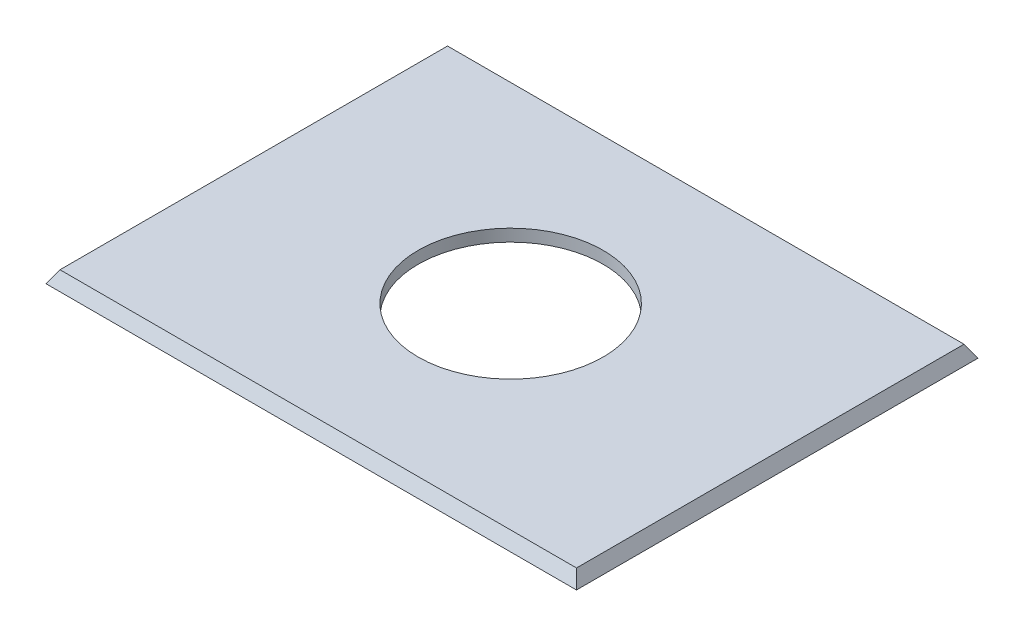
ISO-10303-21;
HEADER;
FILE_DESCRIPTION(('STEP AP214'),'2;1');
FILE_NAME('part.step','',(''),(''),'','','');
FILE_SCHEMA(('AUTOMOTIVE_DESIGN { 1 0 10303 214 1 1 1 1 }'));
ENDSEC;
DATA;
#1=APPLICATION_CONTEXT('core data for automotive mechanical design processes');
#2=APPLICATION_PROTOCOL_DEFINITION('international standard','automotive_design',2000,#1);
#3=PRODUCT_CONTEXT('',#1,'mechanical');
#4=PRODUCT('Part','Part','',(#3));
#5=PRODUCT_RELATED_PRODUCT_CATEGORY('part','',(#4));
#6=PRODUCT_DEFINITION_FORMATION('','',#4);
#7=PRODUCT_DEFINITION_CONTEXT('part definition',#1,'design');
#8=PRODUCT_DEFINITION('design','',#6,#7);
#9=PRODUCT_DEFINITION_SHAPE('','',#8);
#10=(LENGTH_UNIT() NAMED_UNIT(*) SI_UNIT(.MILLI.,.METRE.));
#11=(NAMED_UNIT(*) PLANE_ANGLE_UNIT() SI_UNIT($,.RADIAN.));
#12=(NAMED_UNIT(*) SI_UNIT($,.STERADIAN.) SOLID_ANGLE_UNIT());
#13=UNCERTAINTY_MEASURE_WITH_UNIT(LENGTH_MEASURE(1.E-05),#10,'distance_accuracy_value','');
#14=(GEOMETRIC_REPRESENTATION_CONTEXT(3) GLOBAL_UNCERTAINTY_ASSIGNED_CONTEXT((#13)) GLOBAL_UNIT_ASSIGNED_CONTEXT((#10,
#11,#12)) REPRESENTATION_CONTEXT('',''));
#15=CARTESIAN_POINT('',(0.,0.,0.));
#16=DIRECTION('',(0.,0.,1.));
#17=DIRECTION('',(1.,0.,0.));
#18=AXIS2_PLACEMENT_3D('',#15,#16,#17);
#19=CARTESIAN_POINT('',(0.,0.,0.));
#20=DIRECTION('',(-0.866025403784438,0.500000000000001,0.));
#21=DIRECTION('',(-0.500000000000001,-0.866025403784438,0.));
#22=AXIS2_PLACEMENT_3D('',#19,#20,#21);
#23=PLANE('',#22);
#24=DIRECTION('',(0.,0.,1.));
#25=VECTOR('',#24,1.);
#26=CARTESIAN_POINT('',(0.,0.,0.));
#27=LINE('',#26,#25);
#28=CARTESIAN_POINT('',(0.,0.,-84.2861057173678));
#29=VERTEX_POINT('',#28);
#30=CARTESIAN_POINT('',(0.,0.,0.));
#31=VERTEX_POINT('',#30);
#32=EDGE_CURVE('E91',#29,#31,#27,.T.);
#33=ORIENTED_EDGE('',*,*,#32,.T.);
#34=DIRECTION('',(-0.447213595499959,-0.774596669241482,0.447213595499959));
#35=VECTOR('',#34,1.);
#36=CARTESIAN_POINT('',(0.,0.,0.));
#37=LINE('',#36,#35);
#38=CARTESIAN_POINT('',(1.46646968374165,2.54,-1.46646968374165));
#39=VERTEX_POINT('',#38);
#40=EDGE_CURVE('E12',#39,#31,#37,.T.);
#41=ORIENTED_EDGE('',*,*,#40,.F.);
#42=DIRECTION('',(0.,0.,-1.));
#43=VECTOR('',#42,1.);
#44=CARTESIAN_POINT('',(1.46646968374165,2.54,-84.2861057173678));
#45=LINE('',#44,#43);
#46=CARTESIAN_POINT('',(1.46646968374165,2.54,-82.8196360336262));
#47=VERTEX_POINT('',#46);
#48=EDGE_CURVE('E118',#47,#39,#45,.F.);
#49=ORIENTED_EDGE('',*,*,#48,.F.);
#50=DIRECTION('',(-0.447213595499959,-0.774596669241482,-0.447213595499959));
#51=VECTOR('',#50,1.);
#52=CARTESIAN_POINT('',(16.8572211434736,29.1975634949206,-67.4288845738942));
#53=LINE('',#52,#51);
#54=EDGE_CURVE('E103',#47,#29,#53,.T.);
#55=ORIENTED_EDGE('',*,*,#54,.T.);
#56=EDGE_LOOP('',(#33,#41,#49,#55));
#57=FACE_BOUND('',#56,.T.);
#58=ADVANCED_FACE('F45',(#57),#23,.T.);
#59=CARTESIAN_POINT('',(0.,0.,0.));
#60=DIRECTION('',(0.,0.500000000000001,0.866025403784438));
#61=DIRECTION('',(0.,-0.866025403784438,0.500000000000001));
#62=AXIS2_PLACEMENT_3D('',#59,#60,#61);
#63=PLANE('',#62);
#64=DIRECTION('',(1.,0.,0.));
#65=VECTOR('',#64,1.);
#66=CARTESIAN_POINT('',(0.,0.,0.));
#67=LINE('',#66,#65);
#68=CARTESIAN_POINT('',(111.357497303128,0.,0.));
#69=VERTEX_POINT('',#68);
#70=EDGE_CURVE('E87',#31,#69,#67,.T.);
#71=ORIENTED_EDGE('',*,*,#70,.T.);
#72=DIRECTION('',(0.447213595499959,-0.774596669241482,0.447213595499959));
#73=VECTOR('',#72,1.);
#74=CARTESIAN_POINT('',(111.357497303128,0.,0.));
#75=LINE('',#74,#73);
#76=CARTESIAN_POINT('',(109.891027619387,2.54,-1.46646968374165));
#77=VERTEX_POINT('',#76);
#78=EDGE_CURVE('E54',#77,#69,#75,.T.);
#79=ORIENTED_EDGE('',*,*,#78,.F.);
#80=DIRECTION('',(-1.,0.,0.));
#81=VECTOR('',#80,1.);
#82=CARTESIAN_POINT('',(0.,2.54,-1.46646968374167));
#83=LINE('',#82,#81);
#84=EDGE_CURVE('E99',#39,#77,#83,.F.);
#85=ORIENTED_EDGE('',*,*,#84,.F.);
#86=ORIENTED_EDGE('',*,*,#40,.T.);
#87=EDGE_LOOP('',(#71,#79,#85,#86));
#88=FACE_BOUND('',#87,.T.);
#89=ADVANCED_FACE('F47',(#88),#63,.T.);
#90=CARTESIAN_POINT('',(111.357497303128,0.,0.));
#91=DIRECTION('',(0.866025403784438,0.500000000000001,0.));
#92=DIRECTION('',(-0.500000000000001,0.866025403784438,0.));
#93=AXIS2_PLACEMENT_3D('',#90,#91,#92);
#94=PLANE('',#93);
#95=DIRECTION('',(0.,0.,-1.));
#96=VECTOR('',#95,1.);
#97=CARTESIAN_POINT('',(111.357497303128,0.,0.));
#98=LINE('',#97,#96);
#99=CARTESIAN_POINT('',(111.357497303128,0.,-84.2861057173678));
#100=VERTEX_POINT('',#99);
#101=EDGE_CURVE('E92',#69,#100,#98,.T.);
#102=ORIENTED_EDGE('',*,*,#101,.T.);
#103=DIRECTION('',(0.447213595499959,-0.774596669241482,-0.447213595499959));
#104=VECTOR('',#103,1.);
#105=CARTESIAN_POINT('',(89.0859978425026,38.5753686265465,-62.0146062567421));
#106=LINE('',#105,#104);
#107=CARTESIAN_POINT('',(109.891027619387,2.54,-82.8196360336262));
#108=VERTEX_POINT('',#107);
#109=EDGE_CURVE('E122',#108,#100,#106,.T.);
#110=ORIENTED_EDGE('',*,*,#109,.F.);
#111=DIRECTION('',(0.,0.,1.));
#112=VECTOR('',#111,1.);
#113=CARTESIAN_POINT('',(109.891027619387,2.54,-84.2861057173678));
#114=LINE('',#113,#112);
#115=EDGE_CURVE('E66',#77,#108,#114,.F.);
#116=ORIENTED_EDGE('',*,*,#115,.F.);
#117=ORIENTED_EDGE('',*,*,#78,.T.);
#118=EDGE_LOOP('',(#102,#110,#116,#117));
#119=FACE_BOUND('',#118,.T.);
#120=ADVANCED_FACE('F129',(#119),#94,.T.);
#121=CARTESIAN_POINT('',(0.,0.,-84.2861057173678));
#122=DIRECTION('',(0.,0.500000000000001,-0.866025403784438));
#123=DIRECTION('',(0.,0.866025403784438,0.500000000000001));
#124=AXIS2_PLACEMENT_3D('',#121,#122,#123);
#125=PLANE('',#124);
#126=DIRECTION('',(-1.,0.,0.));
#127=VECTOR('',#126,1.);
#128=CARTESIAN_POINT('',(0.,0.,-84.2861057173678));
#129=LINE('',#128,#127);
#130=EDGE_CURVE('E116',#100,#29,#129,.T.);
#131=ORIENTED_EDGE('',*,*,#130,.T.);
#132=ORIENTED_EDGE('',*,*,#54,.F.);
#133=DIRECTION('',(1.,0.,0.));
#134=VECTOR('',#133,1.);
#135=CARTESIAN_POINT('',(0.,2.54,-82.8196360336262));
#136=LINE('',#135,#134);
#137=EDGE_CURVE('E49',#108,#47,#136,.F.);
#138=ORIENTED_EDGE('',*,*,#137,.F.);
#139=ORIENTED_EDGE('',*,*,#109,.T.);
#140=EDGE_LOOP('',(#131,#132,#138,#139));
#141=FACE_BOUND('',#140,.T.);
#142=ADVANCED_FACE('F131',(#141),#125,.T.);
#143=CARTESIAN_POINT('',(0.,2.54,-84.2861057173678));
#144=DIRECTION('',(0.,-1.,0.));
#145=DIRECTION('',(0.,0.,-1.));
#146=AXIS2_PLACEMENT_3D('',#143,#144,#145);
#147=PLANE('',#146);
#148=CARTESIAN_POINT('',(54.9361469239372,2.54,-42.6071789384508));
#149=DIRECTION('',(0.,1.,0.));
#150=DIRECTION('',(0.,0.,1.));
#151=AXIS2_PLACEMENT_3D('',#148,#149,#150);
#152=CIRCLE('',#151,19.4132473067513);
#153=CARTESIAN_POINT('',(54.9361469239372,2.54,-23.1939316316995));
#154=VERTEX_POINT('',#153);
#155=EDGE_CURVE('E107',#154,#154,#152,.T.);
#156=ORIENTED_EDGE('',*,*,#155,.F.);
#157=EDGE_LOOP('',(#156));
#158=FACE_BOUND('',#157,.T.);
#159=ORIENTED_EDGE('',*,*,#48,.T.);
#160=ORIENTED_EDGE('',*,*,#84,.T.);
#161=ORIENTED_EDGE('',*,*,#115,.T.);
#162=ORIENTED_EDGE('',*,*,#137,.T.);
#163=EDGE_LOOP('',(#159,#160,#161,#162));
#164=FACE_BOUND('',#163,.T.);
#165=ADVANCED_FACE('F127',(#158,#164),#147,.F.);
#166=CARTESIAN_POINT('',(0.,0.,-84.2861057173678));
#167=DIRECTION('',(0.,-1.,0.));
#168=DIRECTION('',(0.,0.,-1.));
#169=AXIS2_PLACEMENT_3D('',#166,#167,#168);
#170=PLANE('',#169);
#171=CARTESIAN_POINT('',(54.9361469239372,0.,-42.6071789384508));
#172=DIRECTION('',(0.,1.,0.));
#173=DIRECTION('',(0.,0.,1.));
#174=AXIS2_PLACEMENT_3D('',#171,#172,#173);
#175=CIRCLE('',#174,19.4132473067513);
#176=CARTESIAN_POINT('',(54.9361469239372,0.,-23.1939316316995));
#177=VERTEX_POINT('',#176);
#178=EDGE_CURVE('E104',#177,#177,#175,.T.);
#179=ORIENTED_EDGE('',*,*,#178,.T.);
#180=EDGE_LOOP('',(#179));
#181=FACE_BOUND('',#180,.T.);
#182=ORIENTED_EDGE('',*,*,#32,.F.);
#183=ORIENTED_EDGE('',*,*,#130,.F.);
#184=ORIENTED_EDGE('',*,*,#101,.F.);
#185=ORIENTED_EDGE('',*,*,#70,.F.);
#186=EDGE_LOOP('',(#182,#183,#184,#185));
#187=FACE_BOUND('',#186,.T.);
#188=ADVANCED_FACE('F88',(#181,#187),#170,.T.);
#189=CARTESIAN_POINT('',(54.9361469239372,0.,-42.6071789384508));
#190=DIRECTION('',(0.,1.,0.));
#191=DIRECTION('',(0.,0.,1.));
#192=AXIS2_PLACEMENT_3D('',#189,#190,#191);
#193=CYLINDRICAL_SURFACE('',#192,19.4132473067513);
#194=ORIENTED_EDGE('',*,*,#178,.F.);
#195=EDGE_LOOP('',(#194));
#196=FACE_BOUND('',#195,.T.);
#197=ORIENTED_EDGE('',*,*,#155,.T.);
#198=EDGE_LOOP('',(#197));
#199=FACE_BOUND('',#198,.T.);
#200=ADVANCED_FACE('F148',(#196,#199),#193,.F.);
#201=CLOSED_SHELL('',(#58,#89,#120,#142,#165,#188,#200));
#202=MANIFOLD_SOLID_BREP('B2',#201);
#203=ADVANCED_BREP_SHAPE_REPRESENTATION('',(#18,#202),#14);
#204=SHAPE_DEFINITION_REPRESENTATION(#9,#203);
ENDSEC;
END-ISO-10303-21;
